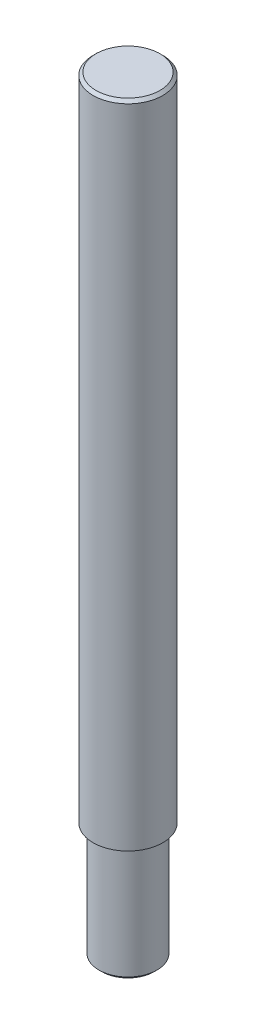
from build123d import *

# Parameters (mm, degrees)
SKETCH1_R      = 2.5
EXTRUDE1_DEPTH = 10
SKETCH2_R      = 3
EXTRUDE2_DEPTH = 56
CHAMFER1_SIZE  = 0.25
CHAMFER2_SIZE  = 0.25


with BuildPart() as part:
    # Sketch1 → Extrude1 (new body)
    with BuildSketch(Plane(origin=(0, 0, 0), x_dir=(1, 0, 0), z_dir=(0, 1, 0))):
        with Locations(Location((0, 0, 0), (0, 0, 270))):
            Circle(SKETCH1_R)
    extrude(amount=-EXTRUDE1_DEPTH)

    # Sketch2 → Extrude2 (add)
    with BuildSketch(Plane(origin=(0, 0, 0), x_dir=(-1, 0, 0), z_dir=(0, 1, 0))):
        with Locations(Location((0, 0, 0), (0, 0, 90))):
            Circle(SKETCH2_R)
    extrude(amount=EXTRUDE2_DEPTH)

    # Chamfer1
    chamfer1_edges = [part.edges().sort_by_distance(p)[0] for p in [
        (0, 56, -3),
    ]]
    chamfer(chamfer1_edges, length=CHAMFER1_SIZE)

    # Chamfer2
    chamfer2_edges = [part.edges().sort_by_distance(p)[0] for p in [
        (0, -10, -2.5),
    ]]
    chamfer(chamfer2_edges, length=CHAMFER2_SIZE)


solid = part.part
